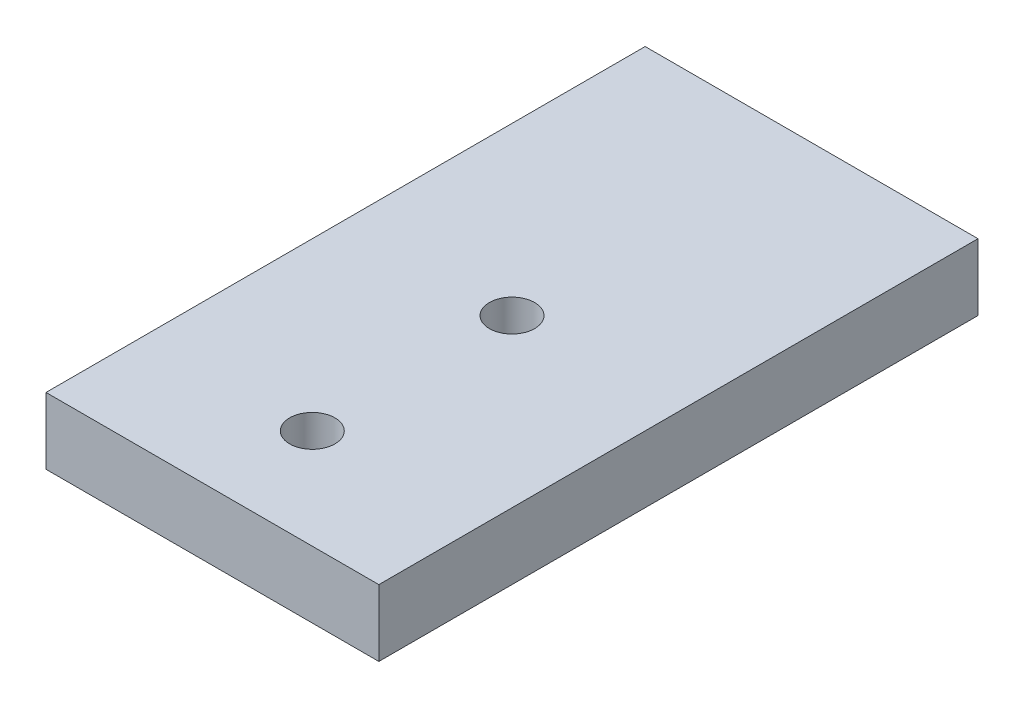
from build123d import *

# Parameters (mm, degrees)
ESQUISSE1_W           = 50
ESQUISSE1_H           = 10
EXTRUSION1_DEPTH      = 45
TROU_TARAUD_M81_D     = 6.8
TROU_TARAUD_M81_DEPTH = 22.25
TROU_TARAUD_M81_TIP   = 2.042926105


with BuildPart() as part:
    # Esquisse1 → Extrusion1 (new, symmetric)
    with BuildSketch(Plane.XY):
        with Locations((25, 5)):
            Rectangle(ESQUISSE1_W, ESQUISSE1_H)
    extrude(amount=EXTRUSION1_DEPTH, both=True)

    # Trou taraud_ M81
    with Locations(Plane(origin=(0, 10, 0), x_dir=(-1, 0, 0), z_dir=(0, 1, 0))):
        with Locations((-25, 30), (-25, 0)):
            Hole(TROU_TARAUD_M81_D / 2, depth=TROU_TARAUD_M81_DEPTH)
            with Locations((0, 0, -(TROU_TARAUD_M81_DEPTH + TROU_TARAUD_M81_TIP / 2))):  # 118° drill point
                Cone(0, TROU_TARAUD_M81_D / 2, TROU_TARAUD_M81_TIP, mode=Mode.SUBTRACT)


solid = part.part
